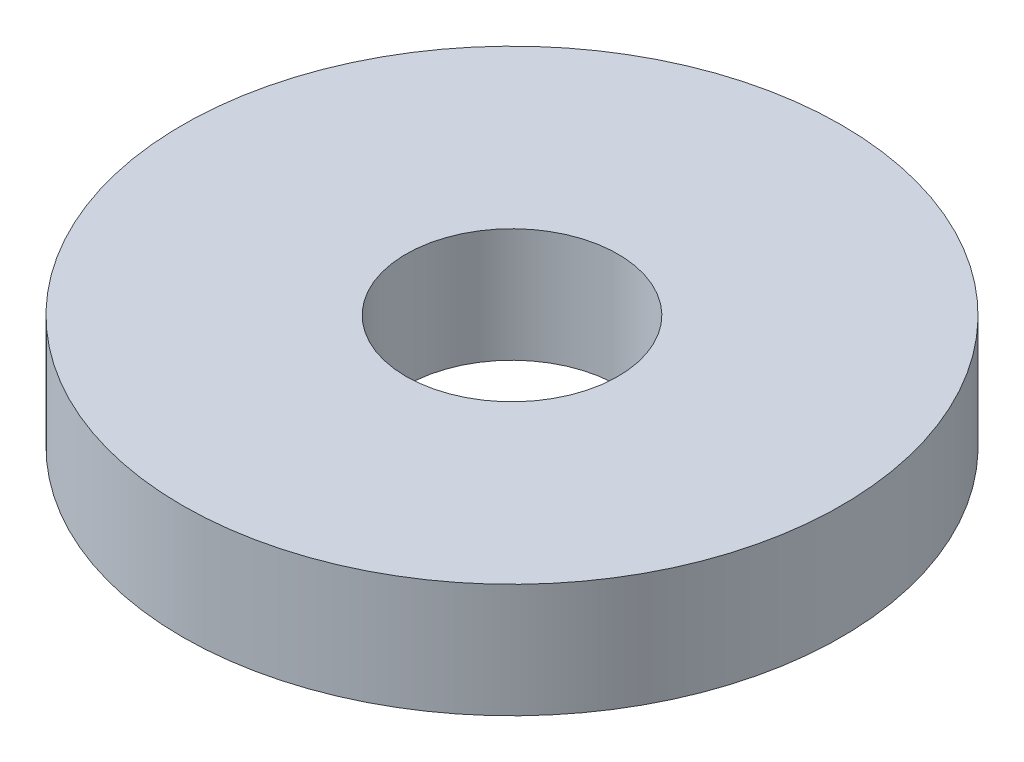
from build123d import *

# Parameters (mm, degrees)
SKETCH1_R           = 7.9375
SKETCH1_R_2         = 2.5527
BOSS_EXTRUDE1_DEPTH = 2.7432


with BuildPart() as part:
    # Sketch1 → Boss-Extrude1 (new body)
    with BuildSketch(Plane(origin=(0, 0, 0), x_dir=(1, 0, 0), z_dir=(0, 1, 0))):
        with Locations(Location((0, 0, 0), (0, 0, 270))):
            Circle(SKETCH1_R)
        with Locations(Location((0, 0, 0), (0, 0, 270))):
            Circle(SKETCH1_R_2, mode=Mode.SUBTRACT)
    extrude(amount=BOSS_EXTRUDE1_DEPTH)


solid = part.part
